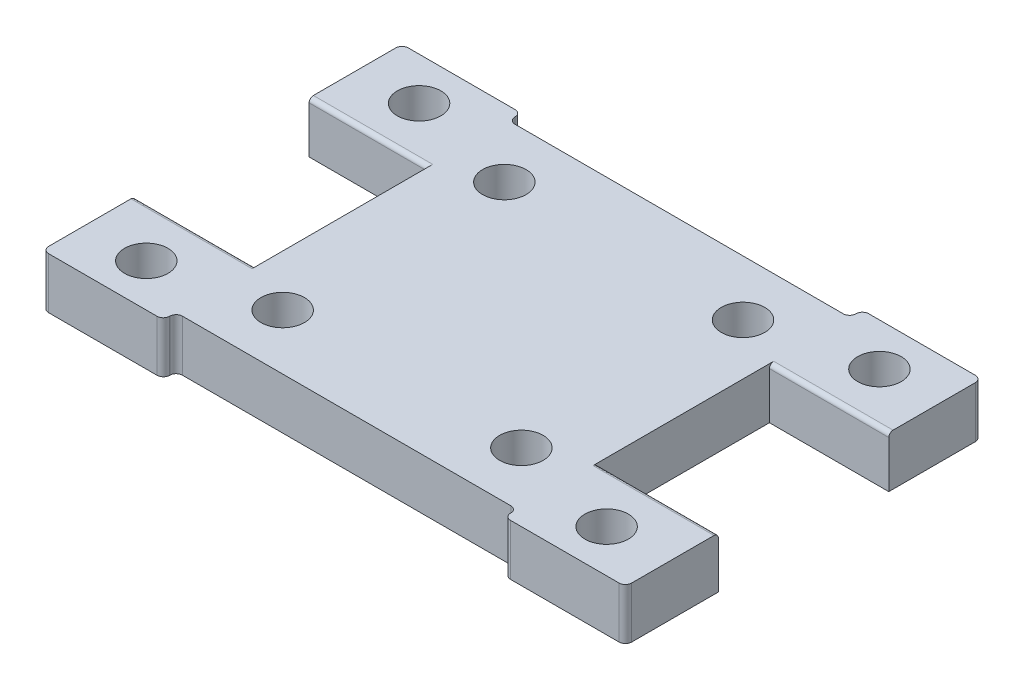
from build123d import *

# Parameters (mm, degrees)
SKETCH1_R           = 2.55
BOSS_EXTRUDE1_DEPTH = 6
FILLET1_R           = 0.74
FILLET2_R           = 0.5


with BuildPart() as part:
    # Sketch1 → Boss-Extrude1 (new body)
    with BuildSketch(Plane(origin=(0, 0, 0), x_dir=(1, 0, 0), z_dir=(0, 1, 0))):
        with BuildLine():
            Line((-19.26, -19.5), (19.26, -19.5))
            ThreePointArc((19.26, -19.5), (19.783259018, -19.716740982), (20, -20.24))
            Line((20, -20.24), (20, -20.26))
            ThreePointArc((20, -20.26), (20.216740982, -20.783259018), (20.74, -21))
            Line((20.74, -21), (34.2, -21))
            Line((34.2, -21), (34.2, -10.099009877))
            Line((34.2, -10.099009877), (20, -10.099009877))
            Line((20, -10.099009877), (20, 10.1))
            Line((20, 10.1), (34, 10.1))
            Line((34, 10.1), (34, 21))
            Line((34, 21), (20.74, 21))
            ThreePointArc((20.74, 21), (20.216740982, 20.783259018), (20, 20.26))
            Line((20, 20.26), (20, 20.24))
            ThreePointArc((20, 20.24), (19.783259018, 19.716740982), (19.26, 19.5))
            Line((19.26, 19.5), (-19.26, 19.5))
            ThreePointArc((-19.26, 19.5), (-19.783259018, 19.716740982), (-20, 20.24))
            Line((-20, 20.24), (-20, 20.26))
            ThreePointArc((-20, 20.26), (-20.216740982, 20.783259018), (-20.74, 21))
            Line((-20.74, 21), (-34, 21))
            Line((-34, 21), (-34, 10.1))
            Line((-34, 10.1), (-20, 10.1))
            Line((-20, 10.1), (-20, -10.099009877))
            Line((-20, -10.099009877), (-34.2, -10.099009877))
            Line((-34.2, -10.099009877), (-34.2, -21))
            Line((-34.2, -21), (-20.74, -21))
            ThreePointArc((-20.74, -21), (-20.216740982, -20.783259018), (-20, -20.26))
            Line((-20, -20.26), (-20, -20.24))
            ThreePointArc((-20, -20.24), (-19.783259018, -19.716740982), (-19.26, -19.5))
        make_face()
        with Locations(Location((-14, 13, 0), (0, 0, 270))):
            Circle(SKETCH1_R, mode=Mode.SUBTRACT)
        with Locations(Location((14, 13, 0), (0, 0, 90))):
            Circle(SKETCH1_R, mode=Mode.SUBTRACT)
        with Locations(Location((14, -13, 0), (0, 0, 270))):
            Circle(SKETCH1_R, mode=Mode.SUBTRACT)
        with Locations(Location((-14, -13, 0), (0, 0, 90))):
            Circle(SKETCH1_R, mode=Mode.SUBTRACT)
        with Locations(Location((27, 16, 0), (0, 0, 270))):
            Circle(SKETCH1_R, mode=Mode.SUBTRACT)
        with Locations(Location((27, -16, 0), (0, 0, 90))):
            Circle(SKETCH1_R, mode=Mode.SUBTRACT)
        with Locations(Location((-27, -16, 0), (0, 0, 270))):
            Circle(SKETCH1_R, mode=Mode.SUBTRACT)
        with Locations(Location((-27, 16, 0), (0, 0, 90))):
            Circle(SKETCH1_R, mode=Mode.SUBTRACT)
    extrude(amount=BOSS_EXTRUDE1_DEPTH)

    # Fillet1
    fillet1_edges = [part.edges().sort_by_distance(p)[0] for p in [
        (34.2, 3, 21),
        (-34.2, 3, 21),
        (-34, 3, -21),
        (34, 3, -21),
    ]]
    fillet(fillet1_edges, radius=FILLET1_R)

    # Fillet2
    fillet2_edges = [part.edges().sort_by_distance(p)[0] for p in [
        (27.1, 6, 10.099009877),
        (-27, 6, -10.1),
        (-27.1, 6, 10.099009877),
        (27, 6, -10.1),
    ]]
    fillet(fillet2_edges, radius=FILLET2_R)


solid = part.part
